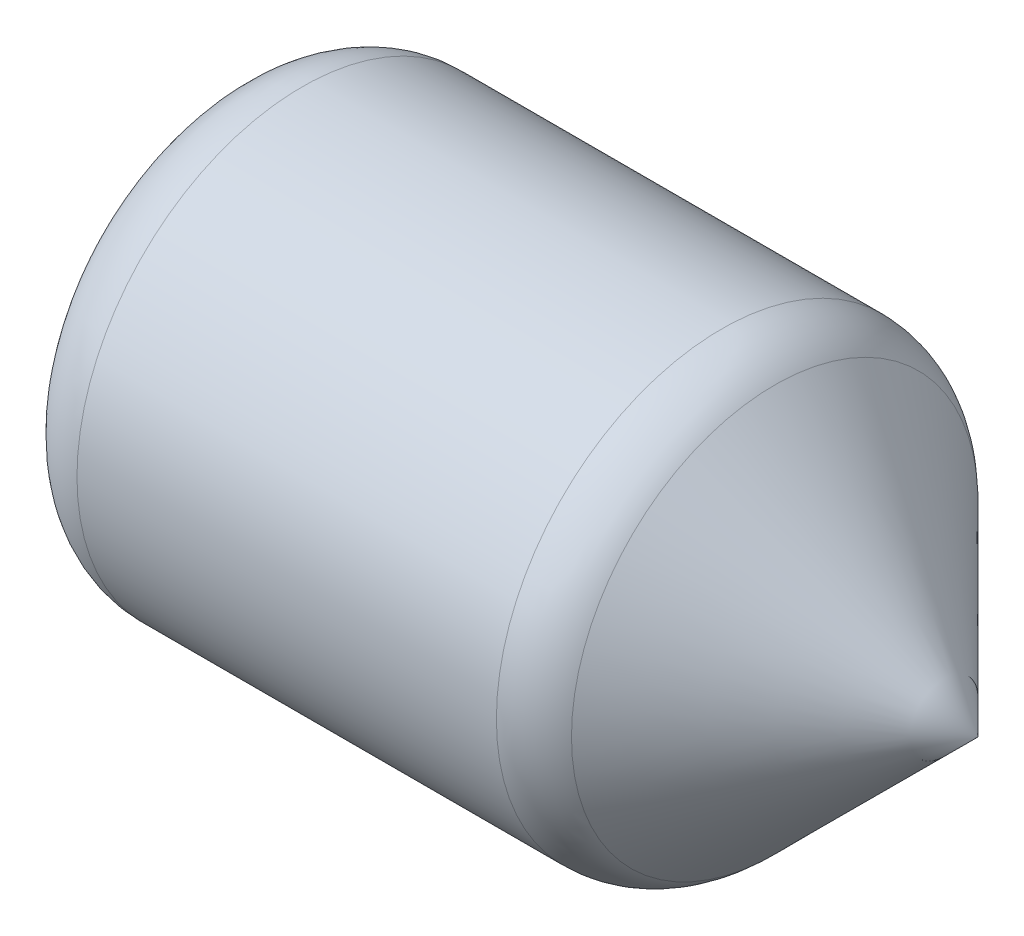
from build123d import *


with BuildPart() as part:
    # Sketch1 → Revolve1 (revolve)
    with BuildSketch(Plane(origin=(0, 0, 0), x_dir=(1, 0, 0), z_dir=(0, 1, 0)), mode=Mode.PRIVATE) as revolve1_sk:
        with BuildLine():
            Line((0, 0), (0, 20))
            ThreePointArc((0, 20), (2.928932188, 27.071067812), (10, 30))
            Line((10, 30), (65.857864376, 30))
            ThreePointArc((65.857864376, 30), (69.6846987, 29.238795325), (72.928932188, 27.071067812))
            Line((72.928932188, 27.071067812), (100, 0))
            Line((100, 0), (0, 0))
        make_face()
    revolve(revolve1_sk.sketch.rotate(Axis((0, 0, 0), (1, 0, 0)), 180), axis=Axis((0, 0, 0), (1, 0, 0)))


solid = part.part
